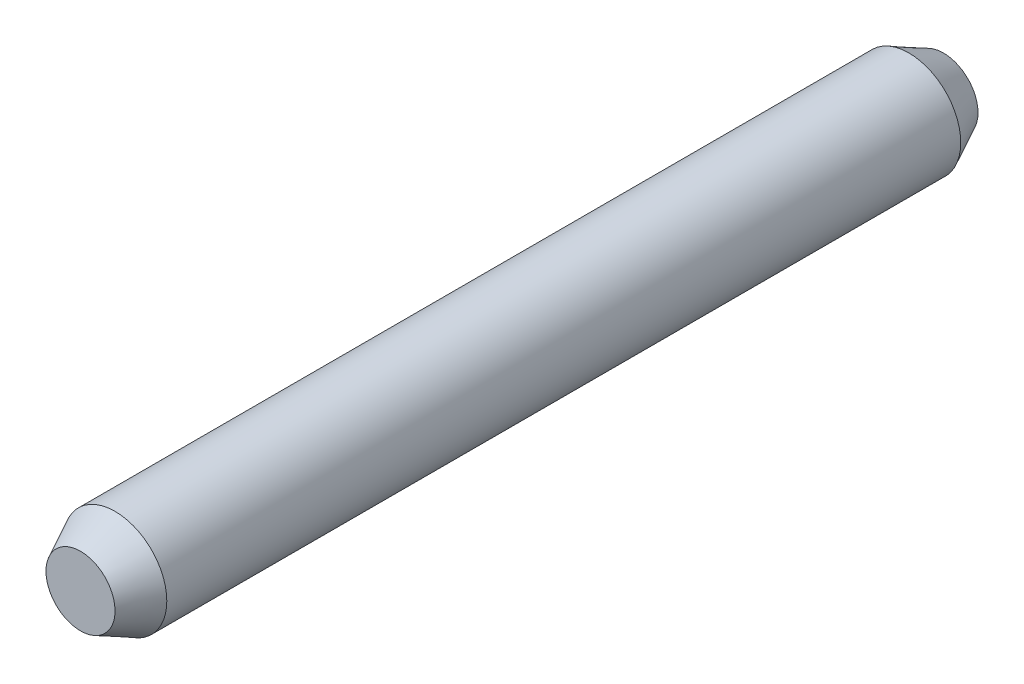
ISO-10303-21;
HEADER;
FILE_DESCRIPTION(('STEP AP214'),'2;1');
FILE_NAME('part.step','',(''),(''),'','','');
FILE_SCHEMA(('AUTOMOTIVE_DESIGN { 1 0 10303 214 1 1 1 1 }'));
ENDSEC;
DATA;
#1=APPLICATION_CONTEXT('core data for automotive mechanical design processes');
#2=APPLICATION_PROTOCOL_DEFINITION('international standard','automotive_design',2000,#1);
#3=PRODUCT_CONTEXT('',#1,'mechanical');
#4=PRODUCT('Part','Part','',(#3));
#5=PRODUCT_RELATED_PRODUCT_CATEGORY('part','',(#4));
#6=PRODUCT_DEFINITION_FORMATION('','',#4);
#7=PRODUCT_DEFINITION_CONTEXT('part definition',#1,'design');
#8=PRODUCT_DEFINITION('design','',#6,#7);
#9=PRODUCT_DEFINITION_SHAPE('','',#8);
#10=(LENGTH_UNIT() NAMED_UNIT(*) SI_UNIT(.MILLI.,.METRE.));
#11=(NAMED_UNIT(*) PLANE_ANGLE_UNIT() SI_UNIT($,.RADIAN.));
#12=(NAMED_UNIT(*) SI_UNIT($,.STERADIAN.) SOLID_ANGLE_UNIT());
#13=UNCERTAINTY_MEASURE_WITH_UNIT(LENGTH_MEASURE(1.E-05),#10,'distance_accuracy_value','');
#14=(GEOMETRIC_REPRESENTATION_CONTEXT(3) GLOBAL_UNCERTAINTY_ASSIGNED_CONTEXT((#13)) GLOBAL_UNIT_ASSIGNED_CONTEXT((#10,
#11,#12)) REPRESENTATION_CONTEXT('',''));
#15=CARTESIAN_POINT('',(0.,0.,0.));
#16=DIRECTION('',(0.,0.,1.));
#17=DIRECTION('',(1.,0.,0.));
#18=AXIS2_PLACEMENT_3D('',#15,#16,#17);
#19=CARTESIAN_POINT('',(0.,0.,25.));
#20=DIRECTION('',(0.,0.,-1.));
#21=DIRECTION('',(-1.,0.,0.));
#22=AXIS2_PLACEMENT_3D('',#19,#20,#21);
#23=PLANE('',#22);
#24=CARTESIAN_POINT('',(0.,0.,25.0000000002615));
#25=DIRECTION('',(0.,0.,-1.));
#26=DIRECTION('',(-1.,0.,0.));
#27=AXIS2_PLACEMENT_3D('',#24,#25,#26);
#28=CIRCLE('',#27,2.00000000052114);
#29=CARTESIAN_POINT('',(-2.00000000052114,0.,25.0000000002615));
#30=VERTEX_POINT('',#29);
#31=EDGE_CURVE('E16',#30,#30,#28,.T.);
#32=ORIENTED_EDGE('',*,*,#31,.F.);
#33=EDGE_LOOP('',(#32));
#34=FACE_BOUND('',#33,.T.);
#35=ADVANCED_FACE('F13',(#34),#23,.F.);
#36=CARTESIAN_POINT('',(0.,0.,-25.));
#37=DIRECTION('',(0.,0.,-1.));
#38=DIRECTION('',(-1.,0.,0.));
#39=AXIS2_PLACEMENT_3D('',#36,#37,#38);
#40=PLANE('',#39);
#41=CARTESIAN_POINT('',(0.,0.,-25.0000000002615));
#42=DIRECTION('',(0.,0.,1.));
#43=DIRECTION('',(1.,0.,0.));
#44=AXIS2_PLACEMENT_3D('',#41,#42,#43);
#45=CIRCLE('',#44,2.00000000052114);
#46=CARTESIAN_POINT('',(2.00000000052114,0.,-25.0000000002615));
#47=VERTEX_POINT('',#46);
#48=EDGE_CURVE('E25',#47,#47,#45,.T.);
#49=ORIENTED_EDGE('',*,*,#48,.F.);
#50=EDGE_LOOP('',(#49));
#51=FACE_BOUND('',#50,.T.);
#52=ADVANCED_FACE('F40',(#51),#40,.T.);
#53=CARTESIAN_POINT('',(0.,0.,22.9999999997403));
#54=DIRECTION('',(0.,0.,-1.));
#55=DIRECTION('',(-1.,0.,0.));
#56=AXIS2_PLACEMENT_3D('',#53,#54,#55);
#57=CONICAL_SURFACE('',#56,2.99999999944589,0.463647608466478);
#58=CARTESIAN_POINT('',(0.,0.,23.));
#59=DIRECTION('',(0.,0.,1.));
#60=DIRECTION('',(1.,0.,0.));
#61=AXIS2_PLACEMENT_3D('',#58,#59,#60);
#62=CIRCLE('',#61,3.);
#63=CARTESIAN_POINT('',(3.,0.,23.));
#64=VERTEX_POINT('',#63);
#65=EDGE_CURVE('E20',#64,#64,#62,.F.);
#66=ORIENTED_EDGE('',*,*,#65,.F.);
#67=EDGE_LOOP('',(#66));
#68=FACE_BOUND('',#67,.T.);
#69=ORIENTED_EDGE('',*,*,#31,.T.);
#70=EDGE_LOOP('',(#69));
#71=FACE_BOUND('',#70,.T.);
#72=ADVANCED_FACE('F37',(#68,#71),#57,.T.);
#73=CARTESIAN_POINT('',(0.,0.,-22.9999999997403));
#74=DIRECTION('',(0.,0.,1.));
#75=DIRECTION('',(1.,0.,0.));
#76=AXIS2_PLACEMENT_3D('',#73,#74,#75);
#77=CONICAL_SURFACE('',#76,2.99999999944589,0.463647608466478);
#78=CARTESIAN_POINT('',(0.,0.,-23.));
#79=DIRECTION('',(0.,0.,1.));
#80=DIRECTION('',(1.,0.,0.));
#81=AXIS2_PLACEMENT_3D('',#78,#79,#80);
#82=CIRCLE('',#81,3.);
#83=CARTESIAN_POINT('',(3.,0.,-23.));
#84=VERTEX_POINT('',#83);
#85=EDGE_CURVE('E9',#84,#84,#82,.T.);
#86=ORIENTED_EDGE('',*,*,#85,.F.);
#87=EDGE_LOOP('',(#86));
#88=FACE_BOUND('',#87,.T.);
#89=ORIENTED_EDGE('',*,*,#48,.T.);
#90=EDGE_LOOP('',(#89));
#91=FACE_BOUND('',#90,.T.);
#92=ADVANCED_FACE('F48',(#88,#91),#77,.T.);
#93=CARTESIAN_POINT('',(0.,0.,0.));
#94=DIRECTION('',(0.,0.,1.));
#95=DIRECTION('',(1.,0.,0.));
#96=AXIS2_PLACEMENT_3D('',#93,#94,#95);
#97=CYLINDRICAL_SURFACE('',#96,3.);
#98=ORIENTED_EDGE('',*,*,#85,.T.);
#99=EDGE_LOOP('',(#98));
#100=FACE_BOUND('',#99,.T.);
#101=ORIENTED_EDGE('',*,*,#65,.T.);
#102=EDGE_LOOP('',(#101));
#103=FACE_BOUND('',#102,.T.);
#104=ADVANCED_FACE('F46',(#100,#103),#97,.T.);
#105=CLOSED_SHELL('',(#35,#52,#72,#92,#104));
#106=MANIFOLD_SOLID_BREP('B1',#105);
#107=ADVANCED_BREP_SHAPE_REPRESENTATION('',(#18,#106),#14);
#108=SHAPE_DEFINITION_REPRESENTATION(#9,#107);
ENDSEC;
END-ISO-10303-21;
